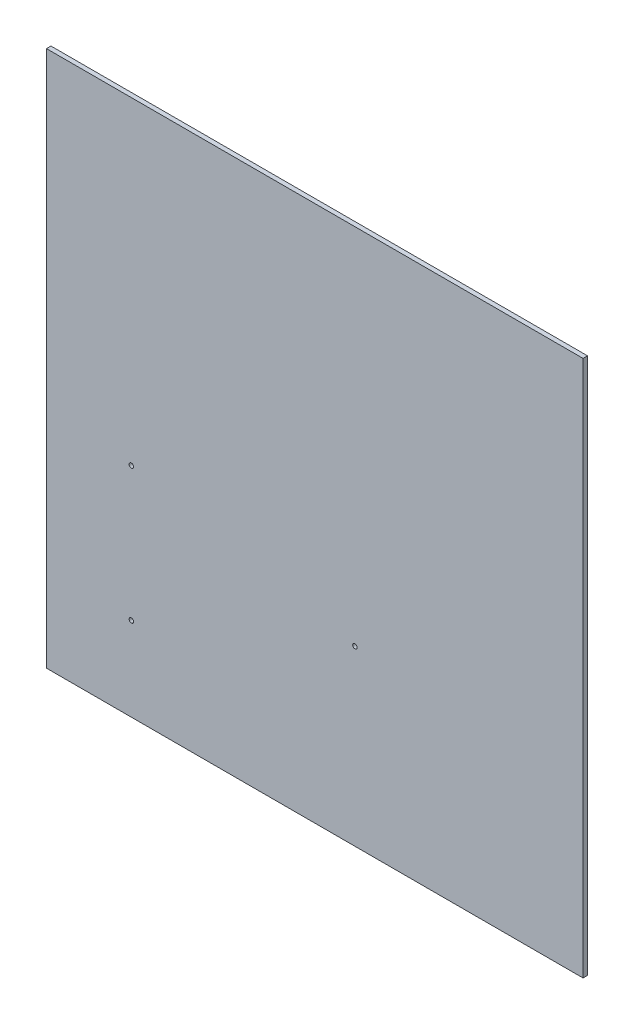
from build123d import *

# Parameters (mm, degrees)
SKETCH1_W               = 304.8
SKETCH1_H               = 304.8
BOSS_EXTRUDE1_DEPTH     = 2.54
CUT_EXTRUDE1_DEPTH      = 432.059777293
CUT_EXTRUDE1_DEPTH_BACK = 432.059777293
SKETCH2_R               = 1.27


with BuildPart() as part:
    # Sketch1 → Boss-Extrude1 (new body)
    with BuildSketch(Plane.XY):
        with Locations((152.4, 152.4)):
            Rectangle(SKETCH1_W, SKETCH1_H)
    extrude(amount=BOSS_EXTRUDE1_DEPTH)

    # Sketch2 → Cut-Extrude1 (cut, two sides: drawn at the far end of the back side and taken through both)
    with BuildSketch(Plane.XY.offset(2.54).offset(-CUT_EXTRUDE1_DEPTH_BACK)):
        with Locations((48.204991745, 47.589666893)):
            Circle(SKETCH2_R)
        with Locations((175.204991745, 98.389666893)):
            Circle(SKETCH2_R)
        with Locations((48.204991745, 123.789666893)):
            Circle(SKETCH2_R)
    extrude(amount=CUT_EXTRUDE1_DEPTH + CUT_EXTRUDE1_DEPTH_BACK, mode=Mode.SUBTRACT)


solid = part.part
